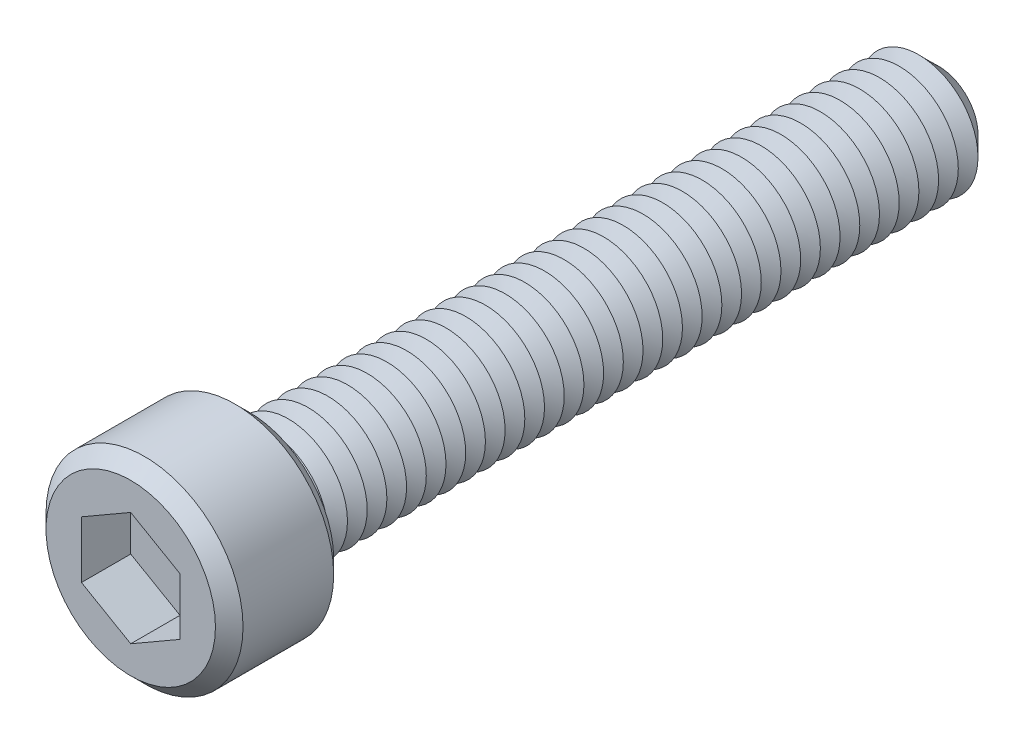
from build123d import *

# Parameters (mm, degrees)
SKETCH1_R           = 5
BOSS_EXTRUDE1_DEPTH = 6
SKETCH2_R           = 3
BOSS_EXTRUDE2_DEPTH = 35
CHAMFER1_SIZE       = 1
LPATTERN1_COUNT     = 34
LPATTERN1_PITCH     = 1
CUT_EXTRUDE1_DEPTH  = 2.5
SKETCH6_R           = 0.8
CUT_EXTRUDE2_DEPTH  = 38.5
CHAMFER2_SIZE       = 0.7


with BuildPart() as part:
    # Sketch1 → Boss-Extrude1 (new body)
    with BuildSketch(Plane.XY):
        Circle(SKETCH1_R)
    extrude(amount=BOSS_EXTRUDE1_DEPTH)

    # Sketch2 → Boss-Extrude2 (add)
    with BuildSketch(Plane(origin=(0, 0, 0), x_dir=(-1, 0, 0), z_dir=(0, 0, -1))):
        Circle(SKETCH2_R)
    extrude(amount=BOSS_EXTRUDE2_DEPTH)

    # Chamfer1
    chamfer1_edges = [part.edges().sort_by_distance(p)[0] for p in [
        (3, 0, -35),
    ]]
    chamfer(chamfer1_edges, length=CHAMFER1_SIZE)

    # Sketch4 → Cut-Revolve1 (revolve, cut)
    with BuildSketch(Plane(origin=(0, 0, 0), x_dir=(0, 0, -1), z_dir=(1, 0, 0)), mode=Mode.PRIVATE) as cut_revolve1_sk:
        Polygon((0, 3), (0.5, 2.133974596), (1, 3), align=None)
    cut_revolve1 = revolve(cut_revolve1_sk.sketch.rotate(Axis((0, 0, 2.512122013), (0, 0, -1)), 90), axis=Axis((0, 0, 2.512122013), (0, 0, -1)), mode=Mode.SUBTRACT)

    # LPattern1: Cut-Revolve1 ×34
    with Locations(*[(0, 0, -i * LPATTERN1_PITCH) for i in range(1, LPATTERN1_COUNT)]):
        add(cut_revolve1, mode=Mode.SUBTRACT)

    # Sketch5 → Cut-Extrude1 (cut)
    with BuildSketch(Plane.XY.offset(6)):
        Polygon((0, 2.886751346), (-2.5, 1.443375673), (-2.5, -1.443375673), (0, -2.886751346), (2.5, -1.443375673), (2.5, 1.443375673), align=None)
    extrude(amount=-CUT_EXTRUDE1_DEPTH, mode=Mode.SUBTRACT)

    # Sketch6 → Cut-Extrude2 (cut)
    with BuildSketch(Plane.XY.offset(3.5)):
        Circle(SKETCH6_R)
    extrude(amount=-CUT_EXTRUDE2_DEPTH, mode=Mode.SUBTRACT)

    # Chamfer2
    chamfer2_edges = [part.edges().sort_by_distance(p)[0] for p in [
        (-5, 0, 0),
        (-5, 0, 6),
    ]]
    chamfer(chamfer2_edges, length=CHAMFER2_SIZE)


solid = part.part
